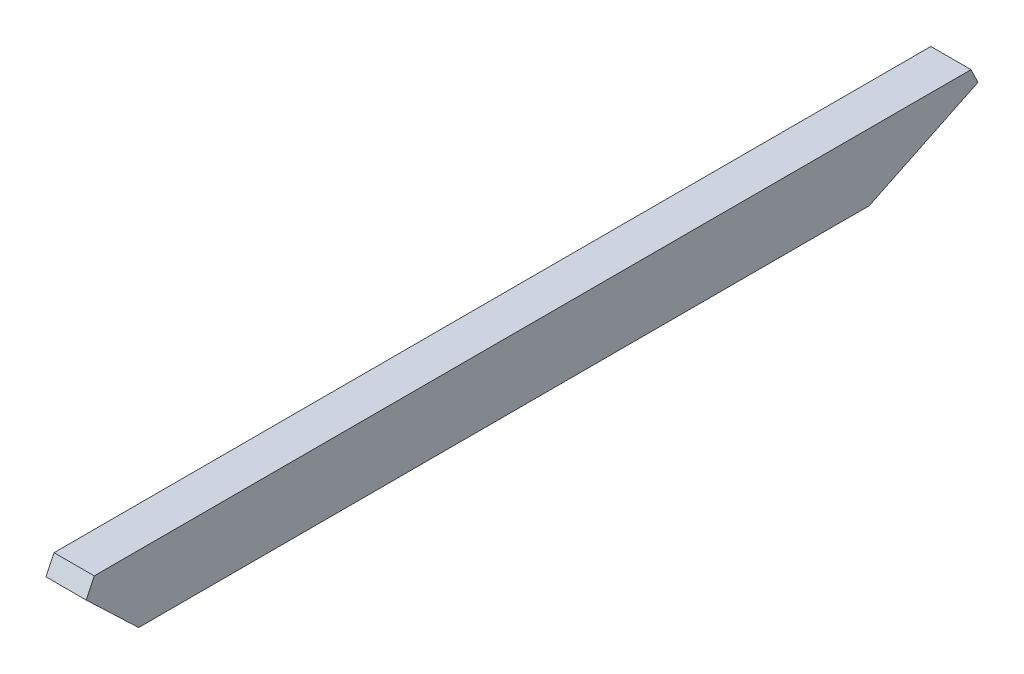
ISO-10303-21;
HEADER;
FILE_DESCRIPTION(('STEP AP214'),'2;1');
FILE_NAME('part.step','',(''),(''),'','','');
FILE_SCHEMA(('AUTOMOTIVE_DESIGN { 1 0 10303 214 1 1 1 1 }'));
ENDSEC;
DATA;
#1=APPLICATION_CONTEXT('core data for automotive mechanical design processes');
#2=APPLICATION_PROTOCOL_DEFINITION('international standard','automotive_design',2000,#1);
#3=PRODUCT_CONTEXT('',#1,'mechanical');
#4=PRODUCT('Part','Part','',(#3));
#5=PRODUCT_RELATED_PRODUCT_CATEGORY('part','',(#4));
#6=PRODUCT_DEFINITION_FORMATION('','',#4);
#7=PRODUCT_DEFINITION_CONTEXT('part definition',#1,'design');
#8=PRODUCT_DEFINITION('design','',#6,#7);
#9=PRODUCT_DEFINITION_SHAPE('','',#8);
#10=(LENGTH_UNIT() NAMED_UNIT(*) SI_UNIT(.MILLI.,.METRE.));
#11=(NAMED_UNIT(*) PLANE_ANGLE_UNIT() SI_UNIT($,.RADIAN.));
#12=(NAMED_UNIT(*) SI_UNIT($,.STERADIAN.) SOLID_ANGLE_UNIT());
#13=UNCERTAINTY_MEASURE_WITH_UNIT(LENGTH_MEASURE(1.E-05),#10,'distance_accuracy_value','');
#14=(GEOMETRIC_REPRESENTATION_CONTEXT(3) GLOBAL_UNCERTAINTY_ASSIGNED_CONTEXT((#13)) GLOBAL_UNIT_ASSIGNED_CONTEXT((#10,
#11,#12)) REPRESENTATION_CONTEXT('',''));
#15=CARTESIAN_POINT('',(0.,0.,0.));
#16=DIRECTION('',(0.,0.,1.));
#17=DIRECTION('',(1.,0.,0.));
#18=AXIS2_PLACEMENT_3D('',#15,#16,#17);
#19=CARTESIAN_POINT('',(0.,0.,333.));
#20=DIRECTION('',(1.,0.,0.));
#21=DIRECTION('',(0.,0.,-1.));
#22=AXIS2_PLACEMENT_3D('',#19,#20,#21);
#23=PLANE('',#22);
#24=DIRECTION('',(0.,0.,-1.));
#25=VECTOR('',#24,1.);
#26=CARTESIAN_POINT('',(0.,0.,333.));
#27=LINE('',#26,#25);
#28=CARTESIAN_POINT('',(0.,0.,313.324490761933));
#29=VERTEX_POINT('',#28);
#30=CARTESIAN_POINT('',(0.,0.,40.6091490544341));
#31=VERTEX_POINT('',#30);
#32=EDGE_CURVE('E11',#29,#31,#27,.T.);
#33=ORIENTED_EDGE('',*,*,#32,.F.);
#34=DIRECTION('',(0.,-0.690136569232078,-0.723679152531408));
#35=VECTOR('',#34,1.);
#36=CARTESIAN_POINT('',(0.,18.6754446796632,332.90761471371));
#37=LINE('',#36,#35);
#38=CARTESIAN_POINT('',(0.,18.6754446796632,332.90761471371));
#39=VERTEX_POINT('',#38);
#40=EDGE_CURVE('E90',#39,#29,#37,.T.);
#41=ORIENTED_EDGE('',*,*,#40,.F.);
#42=DIRECTION('',(0.,-0.903507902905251,0.428571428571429));
#43=VECTOR('',#42,1.);
#44=CARTESIAN_POINT('',(0.,25.,329.90761471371));
#45=LINE('',#44,#43);
#46=CARTESIAN_POINT('',(0.,25.,329.90761471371));
#47=VERTEX_POINT('',#46);
#48=EDGE_CURVE('E79',#47,#39,#45,.T.);
#49=ORIENTED_EDGE('',*,*,#48,.F.);
#50=DIRECTION('',(0.,0.,-1.));
#51=VECTOR('',#50,1.);
#52=CARTESIAN_POINT('',(0.,25.,333.));
#53=LINE('',#52,#51);
#54=CARTESIAN_POINT('',(0.,25.,2.60761471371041));
#55=VERTEX_POINT('',#54);
#56=EDGE_CURVE('E88',#47,#55,#53,.T.);
#57=ORIENTED_EDGE('',*,*,#56,.T.);
#58=DIRECTION('',(0.,0.900622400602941,0.43460245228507));
#59=VECTOR('',#58,1.);
#60=CARTESIAN_POINT('',(0.,25.,2.60761471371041));
#61=LINE('',#60,#59);
#62=CARTESIAN_POINT('',(0.,19.5962655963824,0.));
#63=VERTEX_POINT('',#62);
#64=EDGE_CURVE('E121',#63,#55,#61,.T.);
#65=ORIENTED_EDGE('',*,*,#64,.F.);
#66=DIRECTION('',(0.,0.434602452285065,-0.900622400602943));
#67=VECTOR('',#66,1.);
#68=CARTESIAN_POINT('',(0.,19.5962655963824,0.));
#69=LINE('',#68,#67);
#70=EDGE_CURVE('E118',#31,#63,#69,.T.);
#71=ORIENTED_EDGE('',*,*,#70,.F.);
#72=EDGE_LOOP('',(#33,#41,#49,#57,#65,#71));
#73=FACE_BOUND('',#72,.T.);
#74=ADVANCED_FACE('F26',(#73),#23,.F.);
#75=CARTESIAN_POINT('',(0.,0.,333.));
#76=DIRECTION('',(0.,1.,0.));
#77=DIRECTION('',(0.,0.,1.));
#78=AXIS2_PLACEMENT_3D('',#75,#76,#77);
#79=PLANE('',#78);
#80=DIRECTION('',(0.,0.,-1.));
#81=VECTOR('',#80,1.);
#82=CARTESIAN_POINT('',(15.,0.,333.));
#83=LINE('',#82,#81);
#84=CARTESIAN_POINT('',(15.,0.,313.324490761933));
#85=VERTEX_POINT('',#84);
#86=CARTESIAN_POINT('',(15.,0.,40.6091490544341));
#87=VERTEX_POINT('',#86);
#88=EDGE_CURVE('E33',#85,#87,#83,.T.);
#89=ORIENTED_EDGE('',*,*,#88,.F.);
#90=DIRECTION('',(-1.,0.,0.));
#91=VECTOR('',#90,1.);
#92=CARTESIAN_POINT('',(15.,0.,313.324490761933));
#93=LINE('',#92,#91);
#94=EDGE_CURVE('E129',#85,#29,#93,.T.);
#95=ORIENTED_EDGE('',*,*,#94,.T.);
#96=ORIENTED_EDGE('',*,*,#32,.T.);
#97=DIRECTION('',(-1.,0.,0.));
#98=VECTOR('',#97,1.);
#99=CARTESIAN_POINT('',(15.,0.,40.6091490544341));
#100=LINE('',#99,#98);
#101=EDGE_CURVE('E115',#87,#31,#100,.T.);
#102=ORIENTED_EDGE('',*,*,#101,.F.);
#103=EDGE_LOOP('',(#89,#95,#96,#102));
#104=FACE_BOUND('',#103,.T.);
#105=ADVANCED_FACE('F120',(#104),#79,.F.);
#106=CARTESIAN_POINT('',(15.,0.,333.));
#107=DIRECTION('',(-1.,0.,0.));
#108=DIRECTION('',(0.,0.,1.));
#109=AXIS2_PLACEMENT_3D('',#106,#107,#108);
#110=PLANE('',#109);
#111=DIRECTION('',(0.,-0.903507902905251,0.428571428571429));
#112=VECTOR('',#111,1.);
#113=CARTESIAN_POINT('',(15.,25.,329.90761471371));
#114=LINE('',#113,#112);
#115=CARTESIAN_POINT('',(15.,25.,329.90761471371));
#116=VERTEX_POINT('',#115);
#117=CARTESIAN_POINT('',(15.,18.6754446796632,332.90761471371));
#118=VERTEX_POINT('',#117);
#119=EDGE_CURVE('E40',#116,#118,#114,.T.);
#120=ORIENTED_EDGE('',*,*,#119,.T.);
#121=DIRECTION('',(0.,-0.690136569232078,-0.723679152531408));
#122=VECTOR('',#121,1.);
#123=CARTESIAN_POINT('',(15.,18.6754446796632,332.90761471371));
#124=LINE('',#123,#122);
#125=EDGE_CURVE('E83',#118,#85,#124,.T.);
#126=ORIENTED_EDGE('',*,*,#125,.T.);
#127=ORIENTED_EDGE('',*,*,#88,.T.);
#128=DIRECTION('',(0.,0.434602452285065,-0.900622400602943));
#129=VECTOR('',#128,1.);
#130=CARTESIAN_POINT('',(15.,19.5962655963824,0.));
#131=LINE('',#130,#129);
#132=CARTESIAN_POINT('',(15.,19.5962655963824,0.));
#133=VERTEX_POINT('',#132);
#134=EDGE_CURVE('E106',#87,#133,#131,.T.);
#135=ORIENTED_EDGE('',*,*,#134,.T.);
#136=DIRECTION('',(0.,0.900622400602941,0.43460245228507));
#137=VECTOR('',#136,1.);
#138=CARTESIAN_POINT('',(15.,25.,2.60761471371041));
#139=LINE('',#138,#137);
#140=CARTESIAN_POINT('',(15.,25.,2.60761471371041));
#141=VERTEX_POINT('',#140);
#142=EDGE_CURVE('E123',#133,#141,#139,.T.);
#143=ORIENTED_EDGE('',*,*,#142,.T.);
#144=DIRECTION('',(0.,0.,-1.));
#145=VECTOR('',#144,1.);
#146=CARTESIAN_POINT('',(15.,25.,333.));
#147=LINE('',#146,#145);
#148=EDGE_CURVE('E47',#116,#141,#147,.T.);
#149=ORIENTED_EDGE('',*,*,#148,.F.);
#150=EDGE_LOOP('',(#120,#126,#127,#135,#143,#149));
#151=FACE_BOUND('',#150,.T.);
#152=ADVANCED_FACE('F104',(#151),#110,.F.);
#153=CARTESIAN_POINT('',(0.,25.,333.));
#154=DIRECTION('',(0.,-1.,0.));
#155=DIRECTION('',(0.,0.,-1.));
#156=AXIS2_PLACEMENT_3D('',#153,#154,#155);
#157=PLANE('',#156);
#158=ORIENTED_EDGE('',*,*,#56,.F.);
#159=DIRECTION('',(-1.,0.,0.));
#160=VECTOR('',#159,1.);
#161=CARTESIAN_POINT('',(15.,25.,329.90761471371));
#162=LINE('',#161,#160);
#163=EDGE_CURVE('E76',#116,#47,#162,.T.);
#164=ORIENTED_EDGE('',*,*,#163,.F.);
#165=ORIENTED_EDGE('',*,*,#148,.T.);
#166=DIRECTION('',(-1.,0.,0.));
#167=VECTOR('',#166,1.);
#168=CARTESIAN_POINT('',(15.,25.,2.60761471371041));
#169=LINE('',#168,#167);
#170=EDGE_CURVE('E93',#141,#55,#169,.T.);
#171=ORIENTED_EDGE('',*,*,#170,.T.);
#172=EDGE_LOOP('',(#158,#164,#165,#171));
#173=FACE_BOUND('',#172,.T.);
#174=ADVANCED_FACE('F92',(#173),#157,.F.);
#175=CARTESIAN_POINT('',(15.,25.,2.60761471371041));
#176=DIRECTION('',(0.,-0.43460245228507,0.900622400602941));
#177=DIRECTION('',(0.,-0.900622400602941,-0.43460245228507));
#178=AXIS2_PLACEMENT_3D('',#175,#176,#177);
#179=PLANE('',#178);
#180=ORIENTED_EDGE('',*,*,#64,.T.);
#181=ORIENTED_EDGE('',*,*,#170,.F.);
#182=ORIENTED_EDGE('',*,*,#142,.F.);
#183=DIRECTION('',(-1.,0.,0.));
#184=VECTOR('',#183,1.);
#185=CARTESIAN_POINT('',(15.,19.5962655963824,0.));
#186=LINE('',#185,#184);
#187=EDGE_CURVE('E96',#133,#63,#186,.T.);
#188=ORIENTED_EDGE('',*,*,#187,.T.);
#189=EDGE_LOOP('',(#180,#181,#182,#188));
#190=FACE_BOUND('',#189,.T.);
#191=ADVANCED_FACE('F128',(#190),#179,.F.);
#192=CARTESIAN_POINT('',(15.,19.5962655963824,0.));
#193=DIRECTION('',(0.,0.900622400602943,0.434602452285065));
#194=DIRECTION('',(0.,-0.434602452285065,0.900622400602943));
#195=AXIS2_PLACEMENT_3D('',#192,#193,#194);
#196=PLANE('',#195);
#197=ORIENTED_EDGE('',*,*,#70,.T.);
#198=ORIENTED_EDGE('',*,*,#187,.F.);
#199=ORIENTED_EDGE('',*,*,#134,.F.);
#200=ORIENTED_EDGE('',*,*,#101,.T.);
#201=EDGE_LOOP('',(#197,#198,#199,#200));
#202=FACE_BOUND('',#201,.T.);
#203=ADVANCED_FACE('F114',(#202),#196,.F.);
#204=CARTESIAN_POINT('',(15.,18.6754446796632,332.90761471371));
#205=DIRECTION('',(0.,0.723679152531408,-0.690136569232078));
#206=DIRECTION('',(0.,0.690136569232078,0.723679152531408));
#207=AXIS2_PLACEMENT_3D('',#204,#205,#206);
#208=PLANE('',#207);
#209=ORIENTED_EDGE('',*,*,#40,.T.);
#210=ORIENTED_EDGE('',*,*,#94,.F.);
#211=ORIENTED_EDGE('',*,*,#125,.F.);
#212=DIRECTION('',(-1.,0.,0.));
#213=VECTOR('',#212,1.);
#214=CARTESIAN_POINT('',(15.,18.6754446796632,332.90761471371));
#215=LINE('',#214,#213);
#216=EDGE_CURVE('E82',#118,#39,#215,.T.);
#217=ORIENTED_EDGE('',*,*,#216,.T.);
#218=EDGE_LOOP('',(#209,#210,#211,#217));
#219=FACE_BOUND('',#218,.T.);
#220=ADVANCED_FACE('F136',(#219),#208,.F.);
#221=CARTESIAN_POINT('',(15.,25.,329.90761471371));
#222=DIRECTION('',(0.,-0.428571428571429,-0.903507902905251));
#223=DIRECTION('',(0.,0.903507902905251,-0.428571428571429));
#224=AXIS2_PLACEMENT_3D('',#221,#222,#223);
#225=PLANE('',#224);
#226=ORIENTED_EDGE('',*,*,#48,.T.);
#227=ORIENTED_EDGE('',*,*,#216,.F.);
#228=ORIENTED_EDGE('',*,*,#119,.F.);
#229=ORIENTED_EDGE('',*,*,#163,.T.);
#230=EDGE_LOOP('',(#226,#227,#228,#229));
#231=FACE_BOUND('',#230,.T.);
#232=ADVANCED_FACE('F78',(#231),#225,.F.);
#233=CLOSED_SHELL('',(#74,#105,#152,#174,#191,#203,#220,#232));
#234=MANIFOLD_SOLID_BREP('B2',#233);
#235=ADVANCED_BREP_SHAPE_REPRESENTATION('',(#18,#234),#14);
#236=SHAPE_DEFINITION_REPRESENTATION(#9,#235);
ENDSEC;
END-ISO-10303-21;
